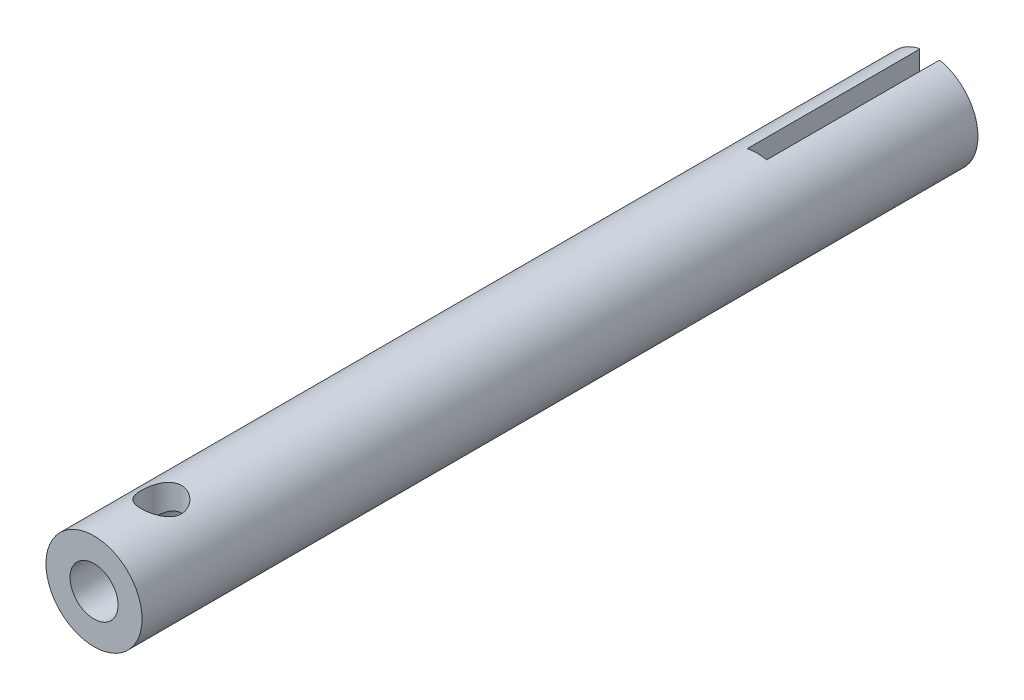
ISO-10303-21;
HEADER;
FILE_DESCRIPTION(('STEP AP214'),'2;1');
FILE_NAME('part.step','',(''),(''),'','','');
FILE_SCHEMA(('AUTOMOTIVE_DESIGN { 1 0 10303 214 1 1 1 1 }'));
ENDSEC;
DATA;
#1=APPLICATION_CONTEXT('core data for automotive mechanical design processes');
#2=APPLICATION_PROTOCOL_DEFINITION('international standard','automotive_design',2000,#1);
#3=PRODUCT_CONTEXT('',#1,'mechanical');
#4=PRODUCT('Part','Part','',(#3));
#5=PRODUCT_RELATED_PRODUCT_CATEGORY('part','',(#4));
#6=PRODUCT_DEFINITION_FORMATION('','',#4);
#7=PRODUCT_DEFINITION_CONTEXT('part definition',#1,'design');
#8=PRODUCT_DEFINITION('design','',#6,#7);
#9=PRODUCT_DEFINITION_SHAPE('','',#8);
#10=(LENGTH_UNIT() NAMED_UNIT(*) SI_UNIT(.MILLI.,.METRE.));
#11=(NAMED_UNIT(*) PLANE_ANGLE_UNIT() SI_UNIT($,.RADIAN.));
#12=(NAMED_UNIT(*) SI_UNIT($,.STERADIAN.) SOLID_ANGLE_UNIT());
#13=UNCERTAINTY_MEASURE_WITH_UNIT(LENGTH_MEASURE(1.E-05),#10,'distance_accuracy_value','');
#14=(GEOMETRIC_REPRESENTATION_CONTEXT(3) GLOBAL_UNCERTAINTY_ASSIGNED_CONTEXT((#13)) GLOBAL_UNIT_ASSIGNED_CONTEXT((#10,
#11,#12)) REPRESENTATION_CONTEXT('',''));
#15=CARTESIAN_POINT('',(0.,0.,0.));
#16=DIRECTION('',(0.,0.,1.));
#17=DIRECTION('',(1.,0.,0.));
#18=AXIS2_PLACEMENT_3D('',#15,#16,#17);
#19=CARTESIAN_POINT('',(0.,0.,0.));
#20=DIRECTION('',(0.,0.,1.));
#21=DIRECTION('',(1.,0.,0.));
#22=AXIS2_PLACEMENT_3D('',#19,#20,#21);
#23=PLANE('',#22);
#24=CARTESIAN_POINT('',(0.,0.,0.));
#25=DIRECTION('',(0.,0.,1.));
#26=DIRECTION('',(1.,0.,0.));
#27=AXIS2_PLACEMENT_3D('',#24,#25,#26);
#28=CIRCLE('',#27,5.);
#29=CARTESIAN_POINT('',(-1.11,4.87523332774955,0.));
#30=VERTEX_POINT('',#29);
#31=CARTESIAN_POINT('',(-1.11,-4.87523332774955,0.));
#32=VERTEX_POINT('',#31);
#33=EDGE_CURVE('E142',#30,#32,#28,.T.);
#34=ORIENTED_EDGE('',*,*,#33,.F.);
#35=DIRECTION('',(0.,-1.,0.));
#36=VECTOR('',#35,1.);
#37=CARTESIAN_POINT('',(-1.11,0.,0.));
#38=LINE('',#37,#36);
#39=EDGE_CURVE('E117',#30,#32,#38,.T.);
#40=ORIENTED_EDGE('',*,*,#39,.T.);
#41=EDGE_LOOP('',(#34,#40));
#42=FACE_BOUND('',#41,.T.);
#43=ADVANCED_FACE('F43',(#42),#23,.F.);
#44=CARTESIAN_POINT('',(0.,0.,87.));
#45=DIRECTION('',(0.,0.,-1.));
#46=DIRECTION('',(-1.,0.,0.));
#47=AXIS2_PLACEMENT_3D('',#44,#45,#46);
#48=CYLINDRICAL_SURFACE('',#47,5.);
#49=CARTESIAN_POINT('',(0.,5.,82.1));
#50=CARTESIAN_POINT('',(-0.112421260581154,4.99999333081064,82.0999912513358));
#51=CARTESIAN_POINT('',(-0.225000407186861,4.99616592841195,82.0909214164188));
#52=CARTESIAN_POINT('',(-0.446972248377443,4.98123118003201,82.0549745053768));
#53=CARTESIAN_POINT('',(-0.55635593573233,4.97010500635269,82.0280513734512));
#54=CARTESIAN_POINT('',(-0.768350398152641,4.94176430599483,81.9575669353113));
#55=CARTESIAN_POINT('',(-0.870982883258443,4.92457055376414,81.9140623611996));
#56=CARTESIAN_POINT('',(-1.06739278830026,4.8857658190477,81.8118871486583));
#57=CARTESIAN_POINT('',(-1.16117280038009,4.8641561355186,81.7532209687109));
#58=CARTESIAN_POINT('',(-1.3421338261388,4.81744880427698,81.6192383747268));
#59=CARTESIAN_POINT('',(-1.42880573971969,4.79223574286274,81.5432749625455));
#60=CARTESIAN_POINT('',(-1.58861874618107,4.74165902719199,81.3782228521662));
#61=CARTESIAN_POINT('',(-1.66175260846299,4.71629529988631,81.2891271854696));
#62=CARTESIAN_POINT('',(-1.79604183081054,4.66686358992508,81.0949219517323));
#63=CARTESIAN_POINT('',(-1.8564119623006,4.64292449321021,80.989233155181));
#64=CARTESIAN_POINT('',(-1.9582903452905,4.60088674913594,80.7680506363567));
#65=CARTESIAN_POINT('',(-1.99980846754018,4.58278504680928,80.6525620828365));
#66=CARTESIAN_POINT('',(-2.06069339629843,4.55572282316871,80.4209186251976));
#67=CARTESIAN_POINT('',(-2.08104088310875,4.54635990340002,80.3050703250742));
#68=CARTESIAN_POINT('',(-2.10206556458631,4.53668036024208,80.0712546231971));
#69=CARTESIAN_POINT('',(-2.10275385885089,4.53635863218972,79.9532884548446));
#70=CARTESIAN_POINT('',(-2.08517838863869,4.54445782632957,79.7284272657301));
#71=CARTESIAN_POINT('',(-2.06839112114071,4.55219766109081,79.621387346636));
#72=CARTESIAN_POINT('',(-2.01882069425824,4.57439532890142,79.4118140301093));
#73=CARTESIAN_POINT('',(-1.98603441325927,4.58885447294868,79.3092815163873));
#74=CARTESIAN_POINT('',(-1.9047552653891,4.62318960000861,79.1090228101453));
#75=CARTESIAN_POINT('',(-1.8559407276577,4.64317507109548,79.0114467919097));
#76=CARTESIAN_POINT('',(-1.74421855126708,4.6862864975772,78.8254875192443));
#77=CARTESIAN_POINT('',(-1.68130530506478,4.70941370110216,78.7371079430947));
#78=CARTESIAN_POINT('',(-1.53682141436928,4.7586218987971,78.5640504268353));
#79=CARTESIAN_POINT('',(-1.4541115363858,4.78478586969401,78.480344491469));
#80=CARTESIAN_POINT('',(-1.27557303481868,4.83544396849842,78.3276620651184));
#81=CARTESIAN_POINT('',(-1.17974124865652,4.85993769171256,78.258689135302));
#82=CARTESIAN_POINT('',(-0.974684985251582,4.90522758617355,78.1359738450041));
#83=CARTESIAN_POINT('',(-0.865196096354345,4.92592190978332,78.0826329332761));
#84=CARTESIAN_POINT('',(-0.637707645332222,4.96049707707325,77.9954695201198));
#85=CARTESIAN_POINT('',(-0.51971290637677,4.97438174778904,77.9616360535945));
#86=CARTESIAN_POINT('',(-0.286679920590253,4.99305470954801,77.9164964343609));
#87=CARTESIAN_POINT('',(-0.171936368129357,4.9983686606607,77.9038862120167));
#88=CARTESIAN_POINT('',(0.0581412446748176,5.00098385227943,77.8976556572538));
#89=CARTESIAN_POINT('',(0.173475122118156,4.99828744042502,77.9040297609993));
#90=CARTESIAN_POINT('',(0.395312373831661,4.98552504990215,77.9346587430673));
#91=CARTESIAN_POINT('',(0.501967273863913,4.9758388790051,77.9579925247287));
#92=CARTESIAN_POINT('',(0.709728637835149,4.95047932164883,78.0205906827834));
#93=CARTESIAN_POINT('',(0.810834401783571,4.93480518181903,78.0598570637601));
#94=CARTESIAN_POINT('',(1.00818189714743,4.8983626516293,78.1544869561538));
#95=CARTESIAN_POINT('',(1.10417428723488,4.87745088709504,78.2103134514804));
#96=CARTESIAN_POINT('',(1.28577300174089,4.83275775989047,78.3359708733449));
#97=CARTESIAN_POINT('',(1.37137493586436,4.80897519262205,78.4058076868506));
#98=CARTESIAN_POINT('',(1.53629380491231,4.75896603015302,78.5634290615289));
#99=CARTESIAN_POINT('',(1.61470399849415,4.73268731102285,78.6521482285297));
#100=CARTESIAN_POINT('',(1.75578239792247,4.68218504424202,78.8418945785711));
#101=CARTESIAN_POINT('',(1.81844681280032,4.65796199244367,78.9429247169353));
#102=CARTESIAN_POINT('',(1.92699302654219,4.61412955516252,79.1566323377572));
#103=CARTESIAN_POINT('',(1.97260446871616,4.59459611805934,79.2694638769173));
#104=CARTESIAN_POINT('',(2.04378702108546,4.56338397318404,79.5022855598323));
#105=CARTESIAN_POINT('',(2.06937501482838,4.55169864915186,79.6222695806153));
#106=CARTESIAN_POINT('',(2.09809375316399,4.53852721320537,79.8559122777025));
#107=CARTESIAN_POINT('',(2.10281966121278,4.53631703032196,79.9693349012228));
#108=CARTESIAN_POINT('',(2.09395263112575,4.54041709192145,80.1952929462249));
#109=CARTESIAN_POINT('',(2.0803626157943,4.54672597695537,80.3078285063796));
#110=CARTESIAN_POINT('',(2.03659654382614,4.56648699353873,80.5232401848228));
#111=CARTESIAN_POINT('',(2.00724892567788,4.57958128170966,80.626320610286));
#112=CARTESIAN_POINT('',(1.9336181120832,4.61115138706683,80.826114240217));
#113=CARTESIAN_POINT('',(1.88933070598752,4.6296287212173,80.9228256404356));
#114=CARTESIAN_POINT('',(1.78398506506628,4.67127236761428,81.1135418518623));
#115=CARTESIAN_POINT('',(1.72207244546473,4.69465512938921,81.2070265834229));
#116=CARTESIAN_POINT('',(1.5844223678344,4.74288120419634,81.3827788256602));
#117=CARTESIAN_POINT('',(1.50867999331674,4.76772503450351,81.4650423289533));
#118=CARTESIAN_POINT('',(1.33881414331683,4.81829681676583,81.6223262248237));
#119=CARTESIAN_POINT('',(1.24374163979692,4.84395273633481,81.6963503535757));
#120=CARTESIAN_POINT('',(1.04160910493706,4.89140406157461,81.8274504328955));
#121=CARTESIAN_POINT('',(0.93454365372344,4.91319771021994,81.8845186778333));
#122=CARTESIAN_POINT('',(0.712909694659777,4.9501639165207,81.9788868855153));
#123=CARTESIAN_POINT('',(0.59848889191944,4.96543696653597,82.0164889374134));
#124=CARTESIAN_POINT('',(0.423046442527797,4.98242021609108,82.0578272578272));
#125=CARTESIAN_POINT('',(0.363983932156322,4.98709206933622,82.0690926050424));
#126=CARTESIAN_POINT('',(0.244993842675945,4.99434801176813,82.086523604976));
#127=CARTESIAN_POINT('',(0.185066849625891,4.99693345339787,82.0926925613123));
#128=CARTESIAN_POINT('',(0.08337889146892,4.99947925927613,82.0987597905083));
#129=CARTESIAN_POINT('',(0.0417003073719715,5.00000247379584,82.1000032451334));
#130=CARTESIAN_POINT('',(0.,5.,82.1));
#131=B_SPLINE_CURVE_WITH_KNOTS('',3,(#49,#50,#51,#52,#53,#54,#55,#56,#57,#58,#59,#60,#61,#62,
#63,#64,#65,#66,#67,#68,#69,#70,#71,#72,#73,#74,#75,#76,#77,#78,#79,#80,#81,#82,#83,#84,#85,#86,
#87,#88,#89,#90,#91,#92,#93,#94,#95,#96,#97,#98,#99,#100,#101,#102,#103,#104,#105,#106,#107,
#108,#109,#110,#111,#112,#113,#114,#115,#116,#117,#118,#119,#120,#121,#122,#123,#124,#125,#126,
#127,#128,#129,#130),.UNSPECIFIED.,.T.,.F.,(4,2,2,2,2,2,2,2,2,2,2,2,2,2,2,2,2,2,2,2,2,2,2,2,2,2,
2,2,2,2,2,2,2,2,2,2,2,2,2,2,4),(0.,0.337117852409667,0.675108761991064,1.01195349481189,
1.34869928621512,1.70109212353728,2.0536726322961,2.42394551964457,2.79402431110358,
3.14607251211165,3.49792194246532,3.82228185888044,4.14670508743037,4.47808378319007,
4.80959451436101,5.16961532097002,5.5297230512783,5.89839924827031,6.26686801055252,
6.61173647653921,6.95650388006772,7.28382587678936,7.6111890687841,7.94874145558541,
8.28643597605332,8.6486338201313,9.01091878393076,9.37872565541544,9.74622206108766,
10.0850701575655,10.4238641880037,10.7463772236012,11.0689812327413,11.4111551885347,
11.7534510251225,12.1212491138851,12.4892140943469,12.851283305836,13.0320009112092,
13.2126012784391,13.3376480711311),.UNSPECIFIED.);
#132=CARTESIAN_POINT('',(0.,5.,82.1));
#133=VERTEX_POINT('',#132);
#134=EDGE_CURVE('E123',#133,#133,#131,.T.);
#135=ORIENTED_EDGE('',*,*,#134,.T.);
#136=EDGE_LOOP('',(#135));
#137=FACE_BOUND('',#136,.T.);
#138=ORIENTED_EDGE('',*,*,#33,.T.);
#139=CARTESIAN_POINT('',(0.,0.,1.11000000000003));
#140=DIRECTION('',(-0.707106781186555,0.,0.70710678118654));
#141=DIRECTION('',(-0.70710678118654,0.,-0.707106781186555));
#142=AXIS2_PLACEMENT_3D('',#139,#140,#141);
#143=ELLIPSE('',#142,7.07106781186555,5.);
#144=CARTESIAN_POINT('',(-1.01,-4.89692760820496,0.100000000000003));
#145=VERTEX_POINT('',#144);
#146=EDGE_CURVE('E151',#32,#145,#143,.T.);
#147=ORIENTED_EDGE('',*,*,#146,.T.);
#148=DIRECTION('',(0.,0.,-1.));
#149=VECTOR('',#148,1.);
#150=CARTESIAN_POINT('',(-1.01,-4.89692760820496,87.));
#151=LINE('',#150,#149);
#152=CARTESIAN_POINT('',(-1.01,-4.89692760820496,18.));
#153=VERTEX_POINT('',#152);
#154=EDGE_CURVE('E128',#145,#153,#151,.F.);
#155=ORIENTED_EDGE('',*,*,#154,.T.);
#156=CARTESIAN_POINT('',(0.,0.,18.));
#157=DIRECTION('',(0.,0.,-1.));
#158=DIRECTION('',(-1.,0.,0.));
#159=AXIS2_PLACEMENT_3D('',#156,#157,#158);
#160=CIRCLE('',#159,5.);
#161=CARTESIAN_POINT('',(1.01,-4.89692760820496,18.));
#162=VERTEX_POINT('',#161);
#163=EDGE_CURVE('E118',#162,#153,#160,.T.);
#164=ORIENTED_EDGE('',*,*,#163,.F.);
#165=DIRECTION('',(0.,0.,-1.));
#166=VECTOR('',#165,1.);
#167=CARTESIAN_POINT('',(1.01,-4.89692760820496,87.));
#168=LINE('',#167,#166);
#169=CARTESIAN_POINT('',(1.01,-4.89692760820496,0.100000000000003));
#170=VERTEX_POINT('',#169);
#171=EDGE_CURVE('E106',#162,#170,#168,.T.);
#172=ORIENTED_EDGE('',*,*,#171,.T.);
#173=CARTESIAN_POINT('',(0.,0.,1.11000000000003));
#174=DIRECTION('',(0.707106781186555,0.,0.70710678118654));
#175=DIRECTION('',(0.70710678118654,0.,-0.707106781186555));
#176=AXIS2_PLACEMENT_3D('',#173,#174,#175);
#177=ELLIPSE('',#176,7.07106781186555,5.);
#178=CARTESIAN_POINT('',(1.11,-4.87523332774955,0.));
#179=VERTEX_POINT('',#178);
#180=EDGE_CURVE('E146',#170,#179,#177,.T.);
#181=ORIENTED_EDGE('',*,*,#180,.T.);
#182=CARTESIAN_POINT('',(1.11,4.87523332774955,0.));
#183=VERTEX_POINT('',#182);
#184=EDGE_CURVE('E138',#179,#183,#28,.T.);
#185=ORIENTED_EDGE('',*,*,#184,.T.);
#186=CARTESIAN_POINT('',(0.,0.,1.11000000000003));
#187=DIRECTION('',(0.707106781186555,0.,0.70710678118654));
#188=DIRECTION('',(0.70710678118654,0.,-0.707106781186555));
#189=AXIS2_PLACEMENT_3D('',#186,#187,#188);
#190=ELLIPSE('',#189,7.07106781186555,5.);
#191=CARTESIAN_POINT('',(1.01,4.89692760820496,0.100000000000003));
#192=VERTEX_POINT('',#191);
#193=EDGE_CURVE('E59',#183,#192,#190,.T.);
#194=ORIENTED_EDGE('',*,*,#193,.T.);
#195=DIRECTION('',(0.,0.,-1.));
#196=VECTOR('',#195,1.);
#197=CARTESIAN_POINT('',(1.01,4.89692760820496,87.));
#198=LINE('',#197,#196);
#199=CARTESIAN_POINT('',(1.01,4.89692760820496,18.));
#200=VERTEX_POINT('',#199);
#201=EDGE_CURVE('E97',#192,#200,#198,.F.);
#202=ORIENTED_EDGE('',*,*,#201,.T.);
#203=CARTESIAN_POINT('',(-1.01,4.89692760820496,18.));
#204=VERTEX_POINT('',#203);
#205=EDGE_CURVE('E103',#204,#200,#160,.T.);
#206=ORIENTED_EDGE('',*,*,#205,.F.);
#207=DIRECTION('',(0.,0.,-1.));
#208=VECTOR('',#207,1.);
#209=CARTESIAN_POINT('',(-1.01,4.89692760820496,87.));
#210=LINE('',#209,#208);
#211=CARTESIAN_POINT('',(-1.01,4.89692760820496,0.100000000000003));
#212=VERTEX_POINT('',#211);
#213=EDGE_CURVE('E130',#204,#212,#210,.T.);
#214=ORIENTED_EDGE('',*,*,#213,.T.);
#215=CARTESIAN_POINT('',(0.,0.,1.11000000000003));
#216=DIRECTION('',(-0.707106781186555,0.,0.70710678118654));
#217=DIRECTION('',(-0.70710678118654,0.,-0.707106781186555));
#218=AXIS2_PLACEMENT_3D('',#215,#216,#217);
#219=ELLIPSE('',#218,7.07106781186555,5.);
#220=EDGE_CURVE('E149',#212,#30,#219,.T.);
#221=ORIENTED_EDGE('',*,*,#220,.T.);
#222=EDGE_LOOP('',(#138,#147,#155,#164,#172,#181,#185,#194,#202,#206,#214,#221));
#223=FACE_BOUND('',#222,.T.);
#224=CARTESIAN_POINT('',(0.,0.,87.));
#225=DIRECTION('',(0.,0.,1.));
#226=DIRECTION('',(1.,0.,0.));
#227=AXIS2_PLACEMENT_3D('',#224,#225,#226);
#228=CIRCLE('',#227,5.);
#229=CARTESIAN_POINT('',(5.,0.,87.));
#230=VERTEX_POINT('',#229);
#231=EDGE_CURVE('E139',#230,#230,#228,.T.);
#232=ORIENTED_EDGE('',*,*,#231,.F.);
#233=EDGE_LOOP('',(#232));
#234=FACE_BOUND('',#233,.T.);
#235=ADVANCED_FACE('F100',(#137,#223,#234),#48,.T.);
#236=CARTESIAN_POINT('',(0.,0.,87.));
#237=DIRECTION('',(0.,0.,1.));
#238=DIRECTION('',(1.,0.,0.));
#239=AXIS2_PLACEMENT_3D('',#236,#237,#238);
#240=PLANE('',#239);
#241=CARTESIAN_POINT('',(0.,0.,87.));
#242=DIRECTION('',(0.,0.,1.));
#243=DIRECTION('',(1.,0.,0.));
#244=AXIS2_PLACEMENT_3D('',#241,#242,#243);
#245=CIRCLE('',#244,2.49999999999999);
#246=CARTESIAN_POINT('',(2.49999999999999,0.,87.));
#247=VERTEX_POINT('',#246);
#248=EDGE_CURVE('E132',#247,#247,#245,.T.);
#249=ORIENTED_EDGE('',*,*,#248,.F.);
#250=EDGE_LOOP('',(#249));
#251=FACE_BOUND('',#250,.T.);
#252=ORIENTED_EDGE('',*,*,#231,.T.);
#253=EDGE_LOOP('',(#252));
#254=FACE_BOUND('',#253,.T.);
#255=ADVANCED_FACE('F174',(#251,#254),#240,.T.);
#256=ORIENTED_EDGE('',*,*,#184,.F.);
#257=DIRECTION('',(0.,1.,0.));
#258=VECTOR('',#257,1.);
#259=CARTESIAN_POINT('',(1.11,0.,0.));
#260=LINE('',#259,#258);
#261=EDGE_CURVE('E52',#179,#183,#260,.T.);
#262=ORIENTED_EDGE('',*,*,#261,.T.);
#263=EDGE_LOOP('',(#256,#262));
#264=FACE_BOUND('',#263,.T.);
#265=ADVANCED_FACE('F156',(#264),#23,.F.);
#266=CARTESIAN_POINT('',(0.,0.,63.5021515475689));
#267=DIRECTION('',(0.,0.,1.));
#268=DIRECTION('',(1.,0.,0.));
#269=AXIS2_PLACEMENT_3D('',#266,#267,#268);
#270=CONICAL_SURFACE('',#269,2.5,1.02974425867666);
#271=CARTESIAN_POINT('',(0.,0.,62.));
#272=VERTEX_POINT('',#271);
#273=VERTEX_LOOP('',#272);
#274=FACE_BOUND('',#273,.T.);
#275=CARTESIAN_POINT('',(0.,0.,63.5021515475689));
#276=DIRECTION('',(0.,0.,1.));
#277=DIRECTION('',(1.,0.,0.));
#278=AXIS2_PLACEMENT_3D('',#275,#276,#277);
#279=CIRCLE('',#278,2.5);
#280=CARTESIAN_POINT('',(2.5,0.,63.5021515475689));
#281=VERTEX_POINT('',#280);
#282=EDGE_CURVE('E135',#281,#281,#279,.T.);
#283=ORIENTED_EDGE('',*,*,#282,.T.);
#284=EDGE_LOOP('',(#283));
#285=FACE_BOUND('',#284,.T.);
#286=ADVANCED_FACE('F180',(#274,#285),#270,.F.);
#287=CARTESIAN_POINT('',(0.,0.,87.));
#288=DIRECTION('',(0.,0.,1.));
#289=DIRECTION('',(1.,0.,0.));
#290=AXIS2_PLACEMENT_3D('',#287,#288,#289);
#291=CYLINDRICAL_SURFACE('',#290,2.49999999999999);
#292=CARTESIAN_POINT('',(0.,2.49999999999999,82.1));
#293=CARTESIAN_POINT('',(0.0993730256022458,2.49999235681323,82.0999921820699));
#294=CARTESIAN_POINT('',(0.198894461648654,2.49401423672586,82.0928850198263));
#295=CARTESIAN_POINT('',(0.394712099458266,2.47062386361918,82.0649547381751));
#296=CARTESIAN_POINT('',(0.49100041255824,2.45318551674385,82.0441003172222));
#297=CARTESIAN_POINT('',(0.676934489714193,2.40849407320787,81.990243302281));
#298=CARTESIAN_POINT('',(0.766619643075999,2.381306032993,81.9573212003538));
#299=CARTESIAN_POINT('',(0.938364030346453,2.31901636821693,81.8810418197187));
#300=CARTESIAN_POINT('',(1.02042318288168,2.28391465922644,81.8376844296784));
#301=CARTESIAN_POINT('',(1.20508095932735,2.19360207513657,81.7243770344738));
#302=CARTESIAN_POINT('',(1.30400396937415,2.13576228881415,81.650529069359));
#303=CARTESIAN_POINT('',(1.48564887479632,2.0136759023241,81.4891902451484));
#304=CARTESIAN_POINT('',(1.56832369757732,1.9494114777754,81.4016610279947));
#305=CARTESIAN_POINT('',(1.71877589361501,1.81821074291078,81.212718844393));
#306=CARTESIAN_POINT('',(1.78623999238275,1.75124686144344,81.1110734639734));
#307=CARTESIAN_POINT('',(1.87423794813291,1.65503457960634,80.9491991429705));
#308=CARTESIAN_POINT('',(1.90135639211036,1.62369006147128,80.8937158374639));
#309=CARTESIAN_POINT('',(1.95101171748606,1.56366934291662,80.7793830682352));
#310=CARTESIAN_POINT('',(1.97355246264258,1.53499090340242,80.7205364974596));
#311=CARTESIAN_POINT('',(2.01536124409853,1.47973546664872,80.5942240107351));
#312=CARTESIAN_POINT('',(2.0342028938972,1.45352993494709,80.5264479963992));
#313=CARTESIAN_POINT('',(2.06527249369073,1.40903910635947,80.3869531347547));
#314=CARTESIAN_POINT('',(2.07751605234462,1.39073513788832,80.3152440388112));
#315=CARTESIAN_POINT('',(2.09459755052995,1.36488977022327,80.1679415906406));
#316=CARTESIAN_POINT('',(2.09933757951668,1.35749074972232,80.0923099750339));
#317=CARTESIAN_POINT('',(2.10053165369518,1.35564367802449,79.940832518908));
#318=CARTESIAN_POINT('',(2.09698775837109,1.36119240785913,79.8649867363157));
#319=CARTESIAN_POINT('',(2.08157225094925,1.38464712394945,79.7111471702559));
#320=CARTESIAN_POINT('',(2.0691755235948,1.40333109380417,79.6333330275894));
#321=CARTESIAN_POINT('',(2.03663853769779,1.45013886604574,79.4821947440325));
#322=CARTESIAN_POINT('',(2.0164719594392,1.47829471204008,79.4088868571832));
#323=CARTESIAN_POINT('',(1.97403882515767,1.53432551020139,79.2811360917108));
#324=CARTESIAN_POINT('',(1.95296589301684,1.56116602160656,79.2258191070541));
#325=CARTESIAN_POINT('',(1.90677427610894,1.61726218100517,79.1181598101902));
#326=CARTESIAN_POINT('',(1.88165311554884,1.64651930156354,79.0658193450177));
#327=CARTESIAN_POINT('',(1.80045722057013,1.73632877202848,78.9129364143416));
#328=CARTESIAN_POINT('',(1.7385737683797,1.79888580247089,78.8166017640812));
#329=CARTESIAN_POINT('',(1.59579178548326,1.9269755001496,78.6295676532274));
#330=CARTESIAN_POINT('',(1.51398796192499,1.99246641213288,78.539534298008));
#331=CARTESIAN_POINT('',(1.33362147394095,2.11741444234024,78.3732143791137));
#332=CARTESIAN_POINT('',(1.23509319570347,2.17688354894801,78.2969002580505));
#333=CARTESIAN_POINT('',(1.04606866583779,2.27250261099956,78.1764675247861));
#334=CARTESIAN_POINT('',(0.958857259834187,2.3108784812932,78.128975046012));
#335=CARTESIAN_POINT('',(0.77562966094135,2.37863696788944,78.0459033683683));
#336=CARTESIAN_POINT('',(0.679618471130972,2.40802465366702,78.0103174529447));
#337=CARTESIAN_POINT('',(0.479938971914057,2.45565985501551,77.9529230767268));
#338=CARTESIAN_POINT('',(0.376214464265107,2.47381430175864,77.9312296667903));
#339=CARTESIAN_POINT('',(0.165239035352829,2.49678205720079,77.9038179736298));
#340=CARTESIAN_POINT('',(0.0579910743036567,2.50160628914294,77.8980866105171));
#341=CARTESIAN_POINT('',(-0.1419825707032,2.49770642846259,77.9027314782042));
#342=CARTESIAN_POINT('',(-0.23479726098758,2.490649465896,77.9111255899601));
#343=CARTESIAN_POINT('',(-0.417235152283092,2.46665360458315,77.9397957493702));
#344=CARTESIAN_POINT('',(-0.506858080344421,2.4497138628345,77.9600728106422));
#345=CARTESIAN_POINT('',(-0.680859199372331,2.40717070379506,78.0113632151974));
#346=CARTESIAN_POINT('',(-0.765231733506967,2.3815581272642,78.0423879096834));
#347=CARTESIAN_POINT('',(-0.927287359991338,2.32326696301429,78.1137365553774));
#348=CARTESIAN_POINT('',(-1.00496777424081,2.29058556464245,78.1540642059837));
#349=CARTESIAN_POINT('',(-1.18582278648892,2.20405034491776,78.2623755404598));
#350=CARTESIAN_POINT('',(-1.28500120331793,2.14723900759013,78.3346880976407));
#351=CARTESIAN_POINT('',(-1.46741117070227,2.0269946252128,78.4928953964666));
#352=CARTESIAN_POINT('',(-1.55059698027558,1.96354336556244,78.5788278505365));
#353=CARTESIAN_POINT('',(-1.70228679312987,1.83365930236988,78.7643408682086));
#354=CARTESIAN_POINT('',(-1.77049341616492,1.76719315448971,78.8641429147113));
#355=CARTESIAN_POINT('',(-1.85989841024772,1.67113985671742,79.0230407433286));
#356=CARTESIAN_POINT('',(-1.88753704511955,1.63974677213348,79.0775051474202));
#357=CARTESIAN_POINT('',(-1.9383572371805,1.57934206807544,79.1897130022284));
#358=CARTESIAN_POINT('',(-1.96154209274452,1.55032869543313,79.2474539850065));
#359=CARTESIAN_POINT('',(-2.00546732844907,1.49316445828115,79.3730947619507));
#360=CARTESIAN_POINT('',(-2.0256447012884,1.46547259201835,79.4414086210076));
#361=CARTESIAN_POINT('',(-2.05928882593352,1.41780992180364,79.5822112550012));
#362=CARTESIAN_POINT('',(-2.07277001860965,1.39782252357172,79.6546906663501));
#363=CARTESIAN_POINT('',(-2.09220045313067,1.36858699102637,79.8039948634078));
#364=CARTESIAN_POINT('',(-2.09804139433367,1.35949342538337,79.8808663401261));
#365=CARTESIAN_POINT('',(-2.1011194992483,1.35473717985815,80.035182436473));
#366=CARTESIAN_POINT('',(-2.09836281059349,1.35906490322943,80.1126266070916));
#367=CARTESIAN_POINT('',(-2.08565152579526,1.37845870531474,80.2536280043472));
#368=CARTESIAN_POINT('',(-2.07682414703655,1.39183839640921,80.3175424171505));
#369=CARTESIAN_POINT('',(-2.05382763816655,1.42555682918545,80.4425337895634));
#370=CARTESIAN_POINT('',(-2.03965016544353,1.44590643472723,80.503606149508));
#371=CARTESIAN_POINT('',(-1.99332588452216,1.50969345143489,80.6700929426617));
#372=CARTESIAN_POINT('',(-1.95587568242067,1.55858039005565,80.7719118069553));
#373=CARTESIAN_POINT('',(-1.86775331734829,1.66319886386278,80.9658630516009));
#374=CARTESIAN_POINT('',(-1.81704180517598,1.71895050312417,81.0579654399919));
#375=CARTESIAN_POINT('',(-1.69917403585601,1.83580085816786,81.2390488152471));
#376=CARTESIAN_POINT('',(-1.63113117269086,1.89700470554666,81.3273869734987));
#377=CARTESIAN_POINT('',(-1.48087039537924,2.01649069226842,81.4931530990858));
#378=CARTESIAN_POINT('',(-1.39867179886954,2.07477667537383,81.5705956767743));
#379=CARTESIAN_POINT('',(-1.22871778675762,2.17927144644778,81.7061325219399));
#380=CARTESIAN_POINT('',(-1.14226966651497,2.22610312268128,81.7653738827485));
#381=CARTESIAN_POINT('',(-0.958257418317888,2.31127343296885,81.8716284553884));
#382=CARTESIAN_POINT('',(-0.860700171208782,2.34961728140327,81.9186491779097));
#383=CARTESIAN_POINT('',(-0.672523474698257,2.40953347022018,81.9915337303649));
#384=CARTESIAN_POINT('',(-0.58329437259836,2.4328081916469,82.0195796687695));
#385=CARTESIAN_POINT('',(-0.400084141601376,2.46953481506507,82.0636747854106));
#386=CARTESIAN_POINT('',(-0.306115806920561,2.48301179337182,82.0797545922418));
#387=CARTESIAN_POINT('',(-0.176152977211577,2.49403576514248,82.0928966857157));
#388=CARTESIAN_POINT('',(-0.14102074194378,2.49626804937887,82.0955560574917));
#389=CARTESIAN_POINT('',(-0.0705986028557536,2.49925166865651,82.0991092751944));
#390=CARTESIAN_POINT('',(-0.0353086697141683,2.50000271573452,82.1000027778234));
#391=CARTESIAN_POINT('',(0.,2.49999999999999,82.1));
#392=B_SPLINE_CURVE_WITH_KNOTS('',3,(#292,#293,#294,#295,#296,#297,#298,#299,#300,#301,#302,
#303,#304,#305,#306,#307,#308,#309,#310,#311,#312,#313,#314,#315,#316,#317,#318,#319,#320,#321,
#322,#323,#324,#325,#326,#327,#328,#329,#330,#331,#332,#333,#334,#335,#336,#337,#338,#339,#340,
#341,#342,#343,#344,#345,#346,#347,#348,#349,#350,#351,#352,#353,#354,#355,#356,#357,#358,#359,
#360,#361,#362,#363,#364,#365,#366,#367,#368,#369,#370,#371,#372,#373,#374,#375,#376,#377,#378,
#379,#380,#381,#382,#383,#384,#385,#386,#387,#388,#389,#390,#391),.UNSPECIFIED.,.T.,.F.,(4,2,2,
2,2,2,2,2,2,2,2,2,2,2,2,2,2,2,2,2,2,2,2,2,2,2,2,2,2,2,2,2,2,2,2,2,2,2,2,2,2,2,2,2,2,2,2,2,2,4),
(0.,0.297962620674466,0.596606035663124,0.893292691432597,1.18998251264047,1.59675200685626,
2.00468312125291,2.42037345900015,2.62792558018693,2.83530178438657,3.05987449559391,
3.28391359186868,3.51085267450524,3.73773534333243,3.97933039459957,4.22175112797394,
4.41648056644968,4.61132955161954,5.00126650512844,5.41417045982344,5.82623552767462,
6.14441396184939,6.46241260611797,6.78301181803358,7.10334824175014,7.38236969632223,
7.66141495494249,7.94075583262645,8.22020798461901,8.62374969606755,9.02842895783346,
9.44053313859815,9.64634836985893,9.85201058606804,10.0806637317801,10.3088216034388,
10.5401797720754,10.771372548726,10.9683042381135,11.1655442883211,11.5205132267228,
11.8765476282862,12.2568989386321,12.63673525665,12.9798180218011,13.3226894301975,
13.6106600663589,13.8978910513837,14.0037408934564,14.1096113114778),.UNSPECIFIED.);
#393=CARTESIAN_POINT('',(0.,2.49999999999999,82.1));
#394=VERTEX_POINT('',#393);
#395=EDGE_CURVE('E208',#394,#394,#392,.T.);
#396=ORIENTED_EDGE('',*,*,#395,.T.);
#397=EDGE_LOOP('',(#396));
#398=FACE_BOUND('',#397,.T.);
#399=ORIENTED_EDGE('',*,*,#282,.F.);
#400=EDGE_LOOP('',(#399));
#401=FACE_BOUND('',#400,.T.);
#402=ORIENTED_EDGE('',*,*,#248,.T.);
#403=EDGE_LOOP('',(#402));
#404=FACE_BOUND('',#403,.T.);
#405=ADVANCED_FACE('F185',(#398,#401,#404),#291,.F.);
#406=CARTESIAN_POINT('',(0.,0.,18.));
#407=DIRECTION('',(0.,0.,-1.));
#408=DIRECTION('',(-1.,0.,0.));
#409=AXIS2_PLACEMENT_3D('',#406,#407,#408);
#410=PLANE('',#409);
#411=ORIENTED_EDGE('',*,*,#205,.T.);
#412=DIRECTION('',(0.,-1.,0.));
#413=VECTOR('',#412,1.);
#414=CARTESIAN_POINT('',(1.01,5.5,18.));
#415=LINE('',#414,#413);
#416=EDGE_CURVE('E107',#200,#162,#415,.T.);
#417=ORIENTED_EDGE('',*,*,#416,.T.);
#418=ORIENTED_EDGE('',*,*,#163,.T.);
#419=DIRECTION('',(0.,1.,0.));
#420=VECTOR('',#419,1.);
#421=CARTESIAN_POINT('',(-1.01,5.5,18.));
#422=LINE('',#421,#420);
#423=EDGE_CURVE('E116',#153,#204,#422,.T.);
#424=ORIENTED_EDGE('',*,*,#423,.T.);
#425=EDGE_LOOP('',(#411,#417,#418,#424));
#426=FACE_BOUND('',#425,.T.);
#427=ADVANCED_FACE('F112',(#426),#410,.T.);
#428=CARTESIAN_POINT('',(-1.01,5.5,18.));
#429=DIRECTION('',(-1.,0.,0.));
#430=DIRECTION('',(0.,-1.,0.));
#431=AXIS2_PLACEMENT_3D('',#428,#429,#430);
#432=PLANE('',#431);
#433=ORIENTED_EDGE('',*,*,#154,.F.);
#434=DIRECTION('',(0.,1.,0.));
#435=VECTOR('',#434,1.);
#436=CARTESIAN_POINT('',(-1.01,5.5,0.100000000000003));
#437=LINE('',#436,#435);
#438=EDGE_CURVE('E153',#145,#212,#437,.T.);
#439=ORIENTED_EDGE('',*,*,#438,.T.);
#440=ORIENTED_EDGE('',*,*,#213,.F.);
#441=ORIENTED_EDGE('',*,*,#423,.F.);
#442=EDGE_LOOP('',(#433,#439,#440,#441));
#443=FACE_BOUND('',#442,.T.);
#444=ADVANCED_FACE('F197',(#443),#432,.F.);
#445=CARTESIAN_POINT('',(1.01,5.5,18.));
#446=DIRECTION('',(1.,0.,0.));
#447=DIRECTION('',(0.,1.,0.));
#448=AXIS2_PLACEMENT_3D('',#445,#446,#447);
#449=PLANE('',#448);
#450=ORIENTED_EDGE('',*,*,#201,.F.);
#451=DIRECTION('',(0.,-1.,0.));
#452=VECTOR('',#451,1.);
#453=CARTESIAN_POINT('',(1.01,5.5,0.100000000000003));
#454=LINE('',#453,#452);
#455=EDGE_CURVE('E11',#192,#170,#454,.T.);
#456=ORIENTED_EDGE('',*,*,#455,.T.);
#457=ORIENTED_EDGE('',*,*,#171,.F.);
#458=ORIENTED_EDGE('',*,*,#416,.F.);
#459=EDGE_LOOP('',(#450,#456,#457,#458));
#460=FACE_BOUND('',#459,.T.);
#461=ADVANCED_FACE('F120',(#460),#449,.F.);
#462=CARTESIAN_POINT('',(-1.11,0.,0.));
#463=DIRECTION('',(-0.707106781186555,0.,0.70710678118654));
#464=DIRECTION('',(0.,-1.,0.));
#465=AXIS2_PLACEMENT_3D('',#462,#463,#464);
#466=PLANE('',#465);
#467=ORIENTED_EDGE('',*,*,#220,.F.);
#468=ORIENTED_EDGE('',*,*,#438,.F.);
#469=ORIENTED_EDGE('',*,*,#146,.F.);
#470=ORIENTED_EDGE('',*,*,#39,.F.);
#471=EDGE_LOOP('',(#467,#468,#469,#470));
#472=FACE_BOUND('',#471,.T.);
#473=ADVANCED_FACE('F160',(#472),#466,.F.);
#474=CARTESIAN_POINT('',(1.11,0.,0.));
#475=DIRECTION('',(0.707106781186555,0.,0.70710678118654));
#476=DIRECTION('',(0.,1.,0.));
#477=AXIS2_PLACEMENT_3D('',#474,#475,#476);
#478=PLANE('',#477);
#479=ORIENTED_EDGE('',*,*,#180,.F.);
#480=ORIENTED_EDGE('',*,*,#455,.F.);
#481=ORIENTED_EDGE('',*,*,#193,.F.);
#482=ORIENTED_EDGE('',*,*,#261,.F.);
#483=EDGE_LOOP('',(#479,#480,#481,#482));
#484=FACE_BOUND('',#483,.T.);
#485=ADVANCED_FACE('F46',(#484),#478,.F.);
#486=CARTESIAN_POINT('',(0.,5.,80.));
#487=DIRECTION('',(0.,1.,0.));
#488=DIRECTION('',(0.,0.,1.));
#489=AXIS2_PLACEMENT_3D('',#486,#487,#488);
#490=CYLINDRICAL_SURFACE('',#489,2.1);
#491=ORIENTED_EDGE('',*,*,#395,.F.);
#492=EDGE_LOOP('',(#491));
#493=FACE_BOUND('',#492,.T.);
#494=ORIENTED_EDGE('',*,*,#134,.F.);
#495=EDGE_LOOP('',(#494));
#496=FACE_BOUND('',#495,.T.);
#497=ADVANCED_FACE('F159',(#493,#496),#490,.F.);
#498=CLOSED_SHELL('',(#43,#235,#255,#265,#286,#405,#427,#444,#461,#473,#485,#497));
#499=MANIFOLD_SOLID_BREP('B2',#498);
#500=ADVANCED_BREP_SHAPE_REPRESENTATION('',(#18,#499),#14);
#501=SHAPE_DEFINITION_REPRESENTATION(#9,#500);
ENDSEC;
END-ISO-10303-21;
